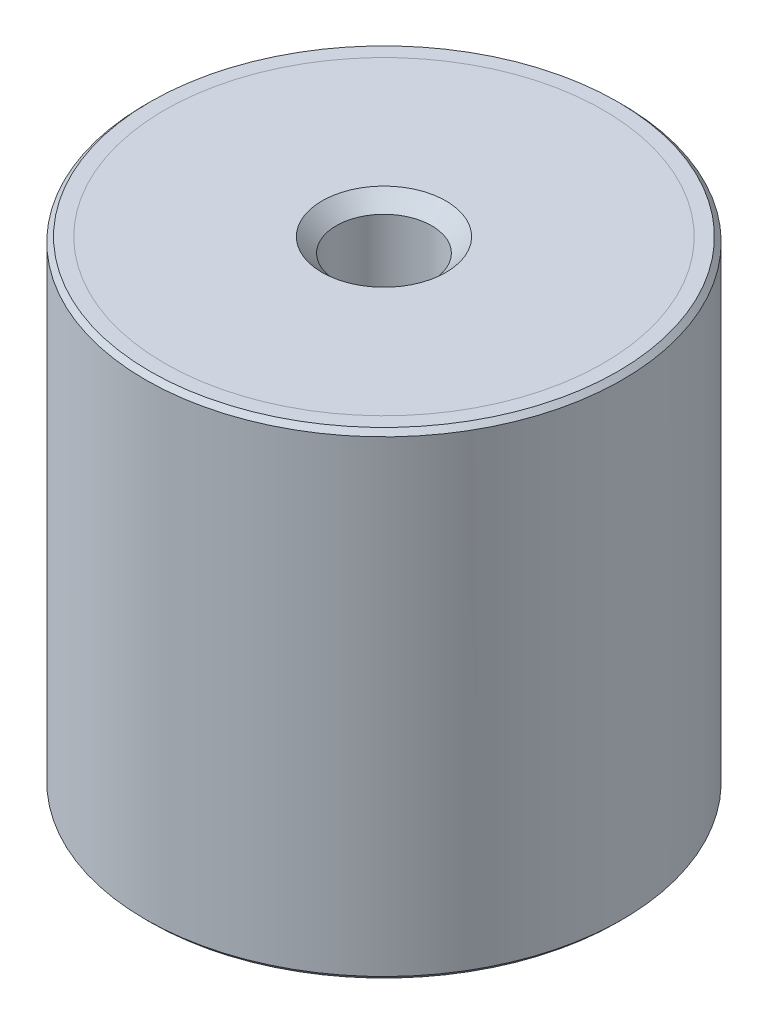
ISO-10303-21;
HEADER;
FILE_DESCRIPTION(('STEP AP214'),'2;1');
FILE_NAME('part.step','',(''),(''),'','','');
FILE_SCHEMA(('AUTOMOTIVE_DESIGN { 1 0 10303 214 1 1 1 1 }'));
ENDSEC;
DATA;
#1=APPLICATION_CONTEXT('core data for automotive mechanical design processes');
#2=APPLICATION_PROTOCOL_DEFINITION('international standard','automotive_design',2000,#1);
#3=PRODUCT_CONTEXT('',#1,'mechanical');
#4=PRODUCT('Part','Part','',(#3));
#5=PRODUCT_RELATED_PRODUCT_CATEGORY('part','',(#4));
#6=PRODUCT_DEFINITION_FORMATION('','',#4);
#7=PRODUCT_DEFINITION_CONTEXT('part definition',#1,'design');
#8=PRODUCT_DEFINITION('design','',#6,#7);
#9=PRODUCT_DEFINITION_SHAPE('','',#8);
#10=(LENGTH_UNIT() NAMED_UNIT(*) SI_UNIT(.MILLI.,.METRE.));
#11=(NAMED_UNIT(*) PLANE_ANGLE_UNIT() SI_UNIT($,.RADIAN.));
#12=(NAMED_UNIT(*) SI_UNIT($,.STERADIAN.) SOLID_ANGLE_UNIT());
#13=UNCERTAINTY_MEASURE_WITH_UNIT(LENGTH_MEASURE(1.E-05),#10,'distance_accuracy_value','');
#14=(GEOMETRIC_REPRESENTATION_CONTEXT(3) GLOBAL_UNCERTAINTY_ASSIGNED_CONTEXT((#13)) GLOBAL_UNIT_ASSIGNED_CONTEXT((#10,
#11,#12)) REPRESENTATION_CONTEXT('',''));
#15=CARTESIAN_POINT('',(0.,0.,0.));
#16=DIRECTION('',(0.,0.,1.));
#17=DIRECTION('',(1.,0.,0.));
#18=AXIS2_PLACEMENT_3D('',#15,#16,#17);
#19=CARTESIAN_POINT('',(0.,-47.,5.));
#20=DIRECTION('',(0.,1.,0.));
#21=DIRECTION('',(0.,0.,1.));
#22=AXIS2_PLACEMENT_3D('',#19,#20,#21);
#23=PLANE('',#22);
#24=CARTESIAN_POINT('',(0.,-47.,0.));
#25=DIRECTION('',(0.,1.,0.));
#26=DIRECTION('',(0.,0.,1.));
#27=AXIS2_PLACEMENT_3D('',#24,#25,#26);
#28=CIRCLE('',#27,23.);
#29=CARTESIAN_POINT('',(0.,-47.,23.));
#30=VERTEX_POINT('',#29);
#31=EDGE_CURVE('P0_E25',#30,#30,#28,.T.);
#32=ORIENTED_EDGE('',*,*,#31,.T.);
#33=EDGE_LOOP('',(#32));
#34=FACE_BOUND('',#33,.T.);
#35=CARTESIAN_POINT('',(0.,-47.,0.));
#36=DIRECTION('',(0.,1.,0.));
#37=DIRECTION('',(0.,0.,1.));
#38=AXIS2_PLACEMENT_3D('',#35,#36,#37);
#39=CIRCLE('',#38,5.);
#40=CARTESIAN_POINT('',(0.,-47.,5.));
#41=VERTEX_POINT('',#40);
#42=EDGE_CURVE('P0_E21',#41,#41,#39,.T.);
#43=ORIENTED_EDGE('',*,*,#42,.F.);
#44=EDGE_LOOP('',(#43));
#45=FACE_BOUND('',#44,.T.);
#46=ADVANCED_FACE('P0_F14',(#34,#45),#23,.T.);
#47=CARTESIAN_POINT('',(0.,21.0340428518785,0.));
#48=DIRECTION('',(0.,1.,0.));
#49=DIRECTION('',(0.,0.,1.));
#50=AXIS2_PLACEMENT_3D('',#47,#48,#49);
#51=CYLINDRICAL_SURFACE('',#50,23.);
#52=CARTESIAN_POINT('',(0.,-48.5,0.));
#53=DIRECTION('',(0.,1.,0.));
#54=DIRECTION('',(0.,0.,1.));
#55=AXIS2_PLACEMENT_3D('',#52,#53,#54);
#56=CIRCLE('',#55,23.);
#57=CARTESIAN_POINT('',(0.,-48.5,23.));
#58=VERTEX_POINT('',#57);
#59=EDGE_CURVE('P0_E29',#58,#58,#56,.T.);
#60=ORIENTED_EDGE('',*,*,#59,.T.);
#61=EDGE_LOOP('',(#60));
#62=FACE_BOUND('',#61,.T.);
#63=ORIENTED_EDGE('',*,*,#31,.F.);
#64=EDGE_LOOP('',(#63));
#65=FACE_BOUND('',#64,.T.);
#66=ADVANCED_FACE('P0_F35',(#62,#65),#51,.T.);
#67=CARTESIAN_POINT('',(0.,-48.5,23.));
#68=DIRECTION('',(0.,-1.,0.));
#69=DIRECTION('',(0.,0.,-1.));
#70=AXIS2_PLACEMENT_3D('',#67,#68,#69);
#71=PLANE('',#70);
#72=CARTESIAN_POINT('',(0.,-48.5,0.));
#73=DIRECTION('',(0.,-1.,0.));
#74=DIRECTION('',(0.,0.,-1.));
#75=AXIS2_PLACEMENT_3D('',#72,#73,#74);
#76=CIRCLE('',#75,6.5);
#77=CARTESIAN_POINT('',(0.,-48.5,-6.5));
#78=VERTEX_POINT('',#77);
#79=EDGE_CURVE('P0_E10',#78,#78,#76,.F.);
#80=ORIENTED_EDGE('',*,*,#79,.T.);
#81=EDGE_LOOP('',(#80));
#82=FACE_BOUND('',#81,.T.);
#83=ORIENTED_EDGE('',*,*,#59,.F.);
#84=EDGE_LOOP('',(#83));
#85=FACE_BOUND('',#84,.T.);
#86=ADVANCED_FACE('P0_F38',(#82,#85),#71,.T.);
#87=CARTESIAN_POINT('',(0.,-48.5,0.));
#88=DIRECTION('',(0.,-1.,0.));
#89=DIRECTION('',(0.,0.,-1.));
#90=AXIS2_PLACEMENT_3D('',#87,#88,#89);
#91=CONICAL_SURFACE('',#90,6.5,0.785398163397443);
#92=ORIENTED_EDGE('',*,*,#42,.T.);
#93=EDGE_LOOP('',(#92));
#94=FACE_BOUND('',#93,.T.);
#95=ORIENTED_EDGE('',*,*,#79,.F.);
#96=EDGE_LOOP('',(#95));
#97=FACE_BOUND('',#96,.T.);
#98=ADVANCED_FACE('P0_F16',(#94,#97),#91,.F.);
#99=CLOSED_SHELL('',(#46,#66,#86,#98));
#100=MANIFOLD_SOLID_BREP('P0_B1',#99);
#101=CARTESIAN_POINT('',(0.,1.5,5.));
#102=DIRECTION('',(0.,1.,0.));
#103=DIRECTION('',(0.,0.,1.));
#104=AXIS2_PLACEMENT_3D('',#101,#102,#103);
#105=PLANE('',#104);
#106=CARTESIAN_POINT('',(0.,1.5,0.));
#107=DIRECTION('',(0.,1.,0.));
#108=DIRECTION('',(0.,0.,1.));
#109=AXIS2_PLACEMENT_3D('',#106,#107,#108);
#110=CIRCLE('',#109,6.5);
#111=CARTESIAN_POINT('',(0.,1.5,6.5));
#112=VERTEX_POINT('',#111);
#113=EDGE_CURVE('P1_E10',#112,#112,#110,.F.);
#114=ORIENTED_EDGE('',*,*,#113,.T.);
#115=EDGE_LOOP('',(#114));
#116=FACE_BOUND('',#115,.T.);
#117=CARTESIAN_POINT('',(0.,1.5,0.));
#118=DIRECTION('',(0.,1.,0.));
#119=DIRECTION('',(0.,0.,1.));
#120=AXIS2_PLACEMENT_3D('',#117,#118,#119);
#121=CIRCLE('',#120,23.);
#122=CARTESIAN_POINT('',(0.,1.5,23.));
#123=VERTEX_POINT('',#122);
#124=EDGE_CURVE('P1_E21',#123,#123,#121,.T.);
#125=ORIENTED_EDGE('',*,*,#124,.T.);
#126=EDGE_LOOP('',(#125));
#127=FACE_BOUND('',#126,.T.);
#128=ADVANCED_FACE('P1_F14',(#116,#127),#105,.T.);
#129=CARTESIAN_POINT('',(0.,69.5340428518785,0.));
#130=DIRECTION('',(0.,1.,0.));
#131=DIRECTION('',(0.,0.,1.));
#132=AXIS2_PLACEMENT_3D('',#129,#130,#131);
#133=CYLINDRICAL_SURFACE('',#132,23.);
#134=CARTESIAN_POINT('',(0.,0.,0.));
#135=DIRECTION('',(0.,1.,0.));
#136=DIRECTION('',(0.,0.,1.));
#137=AXIS2_PLACEMENT_3D('',#134,#135,#136);
#138=CIRCLE('',#137,23.);
#139=CARTESIAN_POINT('',(0.,0.,23.));
#140=VERTEX_POINT('',#139);
#141=EDGE_CURVE('P1_E25',#140,#140,#138,.T.);
#142=ORIENTED_EDGE('',*,*,#141,.T.);
#143=EDGE_LOOP('',(#142));
#144=FACE_BOUND('',#143,.T.);
#145=ORIENTED_EDGE('',*,*,#124,.F.);
#146=EDGE_LOOP('',(#145));
#147=FACE_BOUND('',#146,.T.);
#148=ADVANCED_FACE('P1_F44',(#144,#147),#133,.T.);
#149=CARTESIAN_POINT('',(0.,0.,23.));
#150=DIRECTION('',(0.,-1.,0.));
#151=DIRECTION('',(0.,0.,-1.));
#152=AXIS2_PLACEMENT_3D('',#149,#150,#151);
#153=PLANE('',#152);
#154=CARTESIAN_POINT('',(0.,0.,0.));
#155=DIRECTION('',(0.,1.,0.));
#156=DIRECTION('',(0.,0.,1.));
#157=AXIS2_PLACEMENT_3D('',#154,#155,#156);
#158=CIRCLE('',#157,5.);
#159=CARTESIAN_POINT('',(0.,0.,5.));
#160=VERTEX_POINT('',#159);
#161=EDGE_CURVE('P1_E29',#160,#160,#158,.T.);
#162=ORIENTED_EDGE('',*,*,#161,.T.);
#163=EDGE_LOOP('',(#162));
#164=FACE_BOUND('',#163,.T.);
#165=ORIENTED_EDGE('',*,*,#141,.F.);
#166=EDGE_LOOP('',(#165));
#167=FACE_BOUND('',#166,.T.);
#168=ADVANCED_FACE('P1_F35',(#164,#167),#153,.T.);
#169=CARTESIAN_POINT('',(0.,0.,0.));
#170=DIRECTION('',(0.,1.,0.));
#171=DIRECTION('',(0.,0.,1.));
#172=AXIS2_PLACEMENT_3D('',#169,#170,#171);
#173=CONICAL_SURFACE('',#172,5.,0.78539816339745);
#174=ORIENTED_EDGE('',*,*,#113,.F.);
#175=EDGE_LOOP('',(#174));
#176=FACE_BOUND('',#175,.T.);
#177=ORIENTED_EDGE('',*,*,#161,.F.);
#178=EDGE_LOOP('',(#177));
#179=FACE_BOUND('',#178,.T.);
#180=ADVANCED_FACE('P1_F16',(#176,#179),#173,.F.);
#181=CLOSED_SHELL('',(#128,#148,#168,#180));
#182=MANIFOLD_SOLID_BREP('P1_B1',#181);
#183=CARTESIAN_POINT('',(0.,0.,0.));
#184=DIRECTION('',(0.,1.,0.));
#185=DIRECTION('',(0.,0.,1.));
#186=AXIS2_PLACEMENT_3D('',#183,#184,#185);
#187=PLANE('',#186);
#188=CARTESIAN_POINT('',(0.,0.,0.));
#189=DIRECTION('',(0.,1.,0.));
#190=DIRECTION('',(0.,0.,1.));
#191=AXIS2_PLACEMENT_3D('',#188,#189,#190);
#192=CIRCLE('',#191,5.);
#193=CARTESIAN_POINT('',(0.,0.,5.));
#194=VERTEX_POINT('',#193);
#195=EDGE_CURVE('P2_E46',#194,#194,#192,.T.);
#196=ORIENTED_EDGE('',*,*,#195,.F.);
#197=EDGE_LOOP('',(#196));
#198=FACE_BOUND('',#197,.T.);
#199=CARTESIAN_POINT('',(0.,0.,0.));
#200=DIRECTION('',(0.,1.,0.));
#201=DIRECTION('',(0.,0.,1.));
#202=AXIS2_PLACEMENT_3D('',#199,#200,#201);
#203=CIRCLE('',#202,23.);
#204=CARTESIAN_POINT('',(0.,0.,23.));
#205=VERTEX_POINT('',#204);
#206=EDGE_CURVE('P2_E33',#205,#205,#203,.T.);
#207=ORIENTED_EDGE('',*,*,#206,.T.);
#208=EDGE_LOOP('',(#207));
#209=FACE_BOUND('',#208,.T.);
#210=ADVANCED_FACE('P2_F13',(#198,#209),#187,.T.);
#211=CARTESIAN_POINT('',(0.,65.5134936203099,0.));
#212=DIRECTION('',(0.,1.,0.));
#213=DIRECTION('',(0.,0.,1.));
#214=AXIS2_PLACEMENT_3D('',#211,#212,#213);
#215=CYLINDRICAL_SURFACE('',#214,23.);
#216=CARTESIAN_POINT('',(0.,1.5,0.));
#217=DIRECTION('',(0.,1.,0.));
#218=DIRECTION('',(0.,0.,1.));
#219=AXIS2_PLACEMENT_3D('',#216,#217,#218);
#220=CIRCLE('',#219,23.);
#221=CARTESIAN_POINT('',(0.,1.5,23.));
#222=VERTEX_POINT('',#221);
#223=EDGE_CURVE('P2_E36',#222,#222,#220,.T.);
#224=ORIENTED_EDGE('',*,*,#223,.T.);
#225=EDGE_LOOP('',(#224));
#226=FACE_BOUND('',#225,.T.);
#227=ORIENTED_EDGE('',*,*,#206,.F.);
#228=EDGE_LOOP('',(#227));
#229=FACE_BOUND('',#228,.T.);
#230=ADVANCED_FACE('P2_F92',(#226,#229),#215,.F.);
#231=CARTESIAN_POINT('',(0.,1.5,23.));
#232=DIRECTION('',(0.,1.,0.));
#233=DIRECTION('',(0.,0.,1.));
#234=AXIS2_PLACEMENT_3D('',#231,#232,#233);
#235=PLANE('',#234);
#236=CARTESIAN_POINT('',(0.,1.5,0.));
#237=DIRECTION('',(0.,1.,0.));
#238=DIRECTION('',(0.,0.,1.));
#239=AXIS2_PLACEMENT_3D('',#236,#237,#238);
#240=CIRCLE('',#239,24.5);
#241=CARTESIAN_POINT('',(0.,1.5,24.5));
#242=VERTEX_POINT('',#241);
#243=EDGE_CURVE('P2_E9',#242,#242,#240,.T.);
#244=ORIENTED_EDGE('',*,*,#243,.T.);
#245=EDGE_LOOP('',(#244));
#246=FACE_BOUND('',#245,.T.);
#247=ORIENTED_EDGE('',*,*,#223,.F.);
#248=EDGE_LOOP('',(#247));
#249=FACE_BOUND('',#248,.T.);
#250=ADVANCED_FACE('P2_F88',(#246,#249),#235,.T.);
#251=CARTESIAN_POINT('',(0.,65.5134936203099,0.));
#252=DIRECTION('',(0.,1.,0.));
#253=DIRECTION('',(0.,0.,1.));
#254=AXIS2_PLACEMENT_3D('',#251,#252,#253);
#255=CYLINDRICAL_SURFACE('',#254,25.);
#256=CARTESIAN_POINT('',(0.,-48.,0.));
#257=DIRECTION('',(0.,-1.,0.));
#258=DIRECTION('',(0.,0.,-1.));
#259=AXIS2_PLACEMENT_3D('',#256,#257,#258);
#260=CIRCLE('',#259,25.);
#261=CARTESIAN_POINT('',(0.,-48.,-25.));
#262=VERTEX_POINT('',#261);
#263=EDGE_CURVE('P2_E24',#262,#262,#260,.F.);
#264=ORIENTED_EDGE('',*,*,#263,.T.);
#265=EDGE_LOOP('',(#264));
#266=FACE_BOUND('',#265,.T.);
#267=CARTESIAN_POINT('',(0.,0.999999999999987,0.));
#268=DIRECTION('',(0.,1.,0.));
#269=DIRECTION('',(0.,0.,1.));
#270=AXIS2_PLACEMENT_3D('',#267,#268,#269);
#271=CIRCLE('',#270,25.);
#272=CARTESIAN_POINT('',(0.,0.999999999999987,25.));
#273=VERTEX_POINT('',#272);
#274=EDGE_CURVE('P2_E28',#273,#273,#271,.F.);
#275=ORIENTED_EDGE('',*,*,#274,.T.);
#276=EDGE_LOOP('',(#275));
#277=FACE_BOUND('',#276,.T.);
#278=ADVANCED_FACE('P2_F82',(#266,#277),#255,.T.);
#279=CARTESIAN_POINT('',(0.,-48.5,25.));
#280=DIRECTION('',(0.,-1.,0.));
#281=DIRECTION('',(0.,0.,-1.));
#282=AXIS2_PLACEMENT_3D('',#279,#280,#281);
#283=PLANE('',#282);
#284=CARTESIAN_POINT('',(0.,-48.5,0.));
#285=DIRECTION('',(0.,-1.,0.));
#286=DIRECTION('',(0.,0.,-1.));
#287=AXIS2_PLACEMENT_3D('',#284,#285,#286);
#288=CIRCLE('',#287,24.5);
#289=CARTESIAN_POINT('',(0.,-48.5,-24.5));
#290=VERTEX_POINT('',#289);
#291=EDGE_CURVE('P2_E20',#290,#290,#288,.T.);
#292=ORIENTED_EDGE('',*,*,#291,.T.);
#293=EDGE_LOOP('',(#292));
#294=FACE_BOUND('',#293,.T.);
#295=CARTESIAN_POINT('',(0.,-48.5,0.));
#296=DIRECTION('',(0.,1.,0.));
#297=DIRECTION('',(0.,0.,1.));
#298=AXIS2_PLACEMENT_3D('',#295,#296,#297);
#299=CIRCLE('',#298,23.);
#300=CARTESIAN_POINT('',(0.,-48.5,23.));
#301=VERTEX_POINT('',#300);
#302=EDGE_CURVE('P2_E39',#301,#301,#299,.T.);
#303=ORIENTED_EDGE('',*,*,#302,.T.);
#304=EDGE_LOOP('',(#303));
#305=FACE_BOUND('',#304,.T.);
#306=ADVANCED_FACE('P2_F77',(#294,#305),#283,.T.);
#307=CARTESIAN_POINT('',(0.,65.5134936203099,0.));
#308=DIRECTION('',(0.,1.,0.));
#309=DIRECTION('',(0.,0.,1.));
#310=AXIS2_PLACEMENT_3D('',#307,#308,#309);
#311=CYLINDRICAL_SURFACE('',#310,23.);
#312=CARTESIAN_POINT('',(0.,-47.,0.));
#313=DIRECTION('',(0.,1.,0.));
#314=DIRECTION('',(0.,0.,1.));
#315=AXIS2_PLACEMENT_3D('',#312,#313,#314);
#316=CIRCLE('',#315,23.);
#317=CARTESIAN_POINT('',(0.,-47.,23.));
#318=VERTEX_POINT('',#317);
#319=EDGE_CURVE('P2_E42',#318,#318,#316,.T.);
#320=ORIENTED_EDGE('',*,*,#319,.T.);
#321=EDGE_LOOP('',(#320));
#322=FACE_BOUND('',#321,.T.);
#323=ORIENTED_EDGE('',*,*,#302,.F.);
#324=EDGE_LOOP('',(#323));
#325=FACE_BOUND('',#324,.T.);
#326=ADVANCED_FACE('P2_F71',(#322,#325),#311,.F.);
#327=CARTESIAN_POINT('',(0.,-47.,23.));
#328=DIRECTION('',(0.,-1.,0.));
#329=DIRECTION('',(0.,0.,-1.));
#330=AXIS2_PLACEMENT_3D('',#327,#328,#329);
#331=PLANE('',#330);
#332=CARTESIAN_POINT('',(0.,-47.,0.));
#333=DIRECTION('',(0.,-1.,0.));
#334=DIRECTION('',(0.,0.,-1.));
#335=AXIS2_PLACEMENT_3D('',#332,#333,#334);
#336=CIRCLE('',#335,5.);
#337=CARTESIAN_POINT('',(0.,-47.,-5.));
#338=VERTEX_POINT('',#337);
#339=EDGE_CURVE('P2_E52',#338,#338,#336,.T.);
#340=ORIENTED_EDGE('',*,*,#339,.F.);
#341=EDGE_LOOP('',(#340));
#342=FACE_BOUND('',#341,.T.);
#343=ORIENTED_EDGE('',*,*,#319,.F.);
#344=EDGE_LOOP('',(#343));
#345=FACE_BOUND('',#344,.T.);
#346=ADVANCED_FACE('P2_F67',(#342,#345),#331,.T.);
#347=CARTESIAN_POINT('',(0.,-48.,0.));
#348=DIRECTION('',(0.,1.,0.));
#349=DIRECTION('',(0.,0.,1.));
#350=AXIS2_PLACEMENT_3D('',#347,#348,#349);
#351=CONICAL_SURFACE('',#350,25.,0.785398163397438);
#352=ORIENTED_EDGE('',*,*,#291,.F.);
#353=EDGE_LOOP('',(#352));
#354=FACE_BOUND('',#353,.T.);
#355=ORIENTED_EDGE('',*,*,#263,.F.);
#356=EDGE_LOOP('',(#355));
#357=FACE_BOUND('',#356,.T.);
#358=ADVANCED_FACE('P2_F70',(#354,#357),#351,.T.);
#359=CARTESIAN_POINT('',(0.,1.5,0.));
#360=DIRECTION('',(0.,-1.,0.));
#361=DIRECTION('',(0.,0.,-1.));
#362=AXIS2_PLACEMENT_3D('',#359,#360,#361);
#363=CONICAL_SURFACE('',#362,24.5,0.785398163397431);
#364=ORIENTED_EDGE('',*,*,#274,.F.);
#365=EDGE_LOOP('',(#364));
#366=FACE_BOUND('',#365,.T.);
#367=ORIENTED_EDGE('',*,*,#243,.F.);
#368=EDGE_LOOP('',(#367));
#369=FACE_BOUND('',#368,.T.);
#370=ADVANCED_FACE('P2_F15',(#366,#369),#363,.T.);
#371=CARTESIAN_POINT('',(0.,-8.5,0.));
#372=DIRECTION('',(0.,1.,0.));
#373=DIRECTION('',(0.,0.,1.));
#374=AXIS2_PLACEMENT_3D('',#371,#372,#373);
#375=CYLINDRICAL_SURFACE('',#374,5.);
#376=CARTESIAN_POINT('',(0.,-8.5,0.));
#377=DIRECTION('',(0.,1.,0.));
#378=DIRECTION('',(0.,0.,1.));
#379=AXIS2_PLACEMENT_3D('',#376,#377,#378);
#380=CIRCLE('',#379,5.);
#381=CARTESIAN_POINT('',(0.,-8.5,5.));
#382=VERTEX_POINT('',#381);
#383=EDGE_CURVE('P2_E45',#382,#382,#380,.T.);
#384=ORIENTED_EDGE('',*,*,#383,.F.);
#385=EDGE_LOOP('',(#384));
#386=FACE_BOUND('',#385,.T.);
#387=ORIENTED_EDGE('',*,*,#195,.T.);
#388=EDGE_LOOP('',(#387));
#389=FACE_BOUND('',#388,.T.);
#390=ADVANCED_FACE('P2_F108',(#386,#389),#375,.F.);
#391=CARTESIAN_POINT('',(0.,-8.5,0.));
#392=DIRECTION('',(0.,1.,0.));
#393=DIRECTION('',(0.,0.,1.));
#394=AXIS2_PLACEMENT_3D('',#391,#392,#393);
#395=PLANE('',#394);
#396=ORIENTED_EDGE('',*,*,#383,.T.);
#397=EDGE_LOOP('',(#396));
#398=FACE_BOUND('',#397,.T.);
#399=ADVANCED_FACE('P2_F63',(#398),#395,.T.);
#400=CARTESIAN_POINT('',(0.,-38.5,0.));
#401=DIRECTION('',(0.,-1.,0.));
#402=DIRECTION('',(0.,0.,-1.));
#403=AXIS2_PLACEMENT_3D('',#400,#401,#402);
#404=CYLINDRICAL_SURFACE('',#403,5.);
#405=CARTESIAN_POINT('',(0.,-38.5,0.));
#406=DIRECTION('',(0.,-1.,0.));
#407=DIRECTION('',(0.,0.,-1.));
#408=AXIS2_PLACEMENT_3D('',#405,#406,#407);
#409=CIRCLE('',#408,5.);
#410=CARTESIAN_POINT('',(0.,-38.5,-5.));
#411=VERTEX_POINT('',#410);
#412=EDGE_CURVE('P2_E49',#411,#411,#409,.T.);
#413=ORIENTED_EDGE('',*,*,#412,.F.);
#414=EDGE_LOOP('',(#413));
#415=FACE_BOUND('',#414,.T.);
#416=ORIENTED_EDGE('',*,*,#339,.T.);
#417=EDGE_LOOP('',(#416));
#418=FACE_BOUND('',#417,.T.);
#419=ADVANCED_FACE('P2_F60',(#415,#418),#404,.F.);
#420=CARTESIAN_POINT('',(0.,-38.5,0.));
#421=DIRECTION('',(0.,-1.,0.));
#422=DIRECTION('',(0.,0.,-1.));
#423=AXIS2_PLACEMENT_3D('',#420,#421,#422);
#424=PLANE('',#423);
#425=ORIENTED_EDGE('',*,*,#412,.T.);
#426=EDGE_LOOP('',(#425));
#427=FACE_BOUND('',#426,.T.);
#428=ADVANCED_FACE('P2_F58',(#427),#424,.T.);
#429=CLOSED_SHELL('',(#210,#230,#250,#278,#306,#326,#346,#358,#370,#390,#399,#419,#428));
#430=MANIFOLD_SOLID_BREP('P2_B1',#429);
#431=ADVANCED_BREP_SHAPE_REPRESENTATION('',(#18,#100,#182,#430),#14);
#432=SHAPE_DEFINITION_REPRESENTATION(#9,#431);
ENDSEC;
END-ISO-10303-21;
